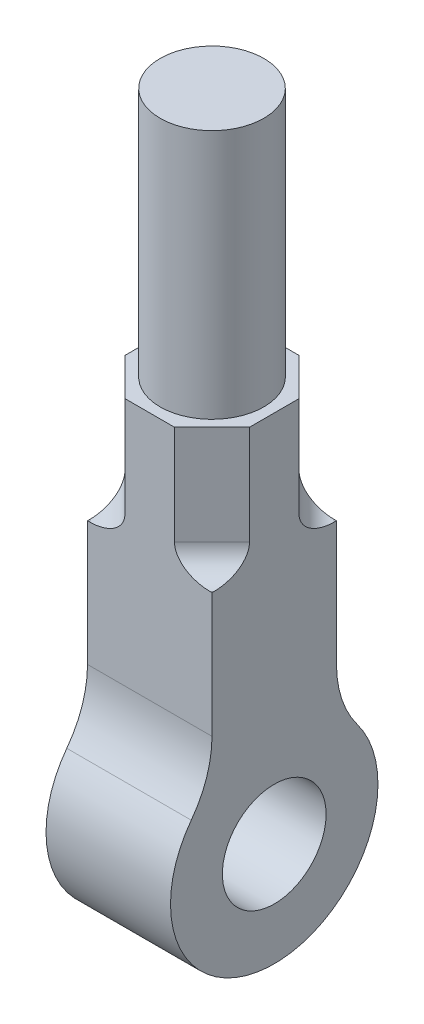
ISO-10303-21;
HEADER;
FILE_DESCRIPTION(('STEP AP214'),'2;1');
FILE_NAME('part.step','',(''),(''),'','','');
FILE_SCHEMA(('AUTOMOTIVE_DESIGN { 1 0 10303 214 1 1 1 1 }'));
ENDSEC;
DATA;
#1=APPLICATION_CONTEXT('core data for automotive mechanical design processes');
#2=APPLICATION_PROTOCOL_DEFINITION('international standard','automotive_design',2000,#1);
#3=PRODUCT_CONTEXT('',#1,'mechanical');
#4=PRODUCT('Part','Part','',(#3));
#5=PRODUCT_RELATED_PRODUCT_CATEGORY('part','',(#4));
#6=PRODUCT_DEFINITION_FORMATION('','',#4);
#7=PRODUCT_DEFINITION_CONTEXT('part definition',#1,'design');
#8=PRODUCT_DEFINITION('design','',#6,#7);
#9=PRODUCT_DEFINITION_SHAPE('','',#8);
#10=(LENGTH_UNIT() NAMED_UNIT(*) SI_UNIT(.MILLI.,.METRE.));
#11=(NAMED_UNIT(*) PLANE_ANGLE_UNIT() SI_UNIT($,.RADIAN.));
#12=(NAMED_UNIT(*) SI_UNIT($,.STERADIAN.) SOLID_ANGLE_UNIT());
#13=UNCERTAINTY_MEASURE_WITH_UNIT(LENGTH_MEASURE(1.E-05),#10,'distance_accuracy_value','');
#14=(GEOMETRIC_REPRESENTATION_CONTEXT(3) GLOBAL_UNCERTAINTY_ASSIGNED_CONTEXT((#13)) GLOBAL_UNIT_ASSIGNED_CONTEXT((#10,
#11,#12)) REPRESENTATION_CONTEXT('',''));
#15=CARTESIAN_POINT('',(0.,0.,0.));
#16=DIRECTION('',(0.,0.,1.));
#17=DIRECTION('',(1.,0.,0.));
#18=AXIS2_PLACEMENT_3D('',#15,#16,#17);
#19=CARTESIAN_POINT('',(60.,60.,-80.));
#20=DIRECTION('',(-1.,0.,0.));
#21=DIRECTION('',(0.,0.,1.));
#22=AXIS2_PLACEMENT_3D('',#19,#20,#21);
#23=PLANE('',#22);
#24=DIRECTION('',(0.,0.,-1.));
#25=VECTOR('',#24,1.);
#26=CARTESIAN_POINT('',(60.,120.,0.));
#27=LINE('',#26,#25);
#28=CARTESIAN_POINT('',(60.,120.,-28.9105627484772));
#29=VERTEX_POINT('',#28);
#30=CARTESIAN_POINT('',(60.,120.,-30.));
#31=VERTEX_POINT('',#30);
#32=EDGE_CURVE('E339',#29,#31,#27,.T.);
#33=ORIENTED_EDGE('',*,*,#32,.F.);
#34=CARTESIAN_POINT('',(60.,132.,-28.9105627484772));
#35=DIRECTION('',(-1.,0.,0.));
#36=DIRECTION('',(0.,0.,1.));
#37=AXIS2_PLACEMENT_3D('',#34,#35,#36);
#38=ELLIPSE('',#37,16.9705627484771,12.);
#39=CARTESIAN_POINT('',(60.,132.,-11.94));
#40=VERTEX_POINT('',#39);
#41=EDGE_CURVE('E224',#29,#40,#38,.T.);
#42=ORIENTED_EDGE('',*,*,#41,.T.);
#43=DIRECTION('',(0.,1.,0.));
#44=VECTOR('',#43,1.);
#45=CARTESIAN_POINT('',(60.,120.,-11.94));
#46=LINE('',#45,#44);
#47=CARTESIAN_POINT('',(60.,180.,-11.94));
#48=VERTEX_POINT('',#47);
#49=EDGE_CURVE('E333',#40,#48,#46,.T.);
#50=ORIENTED_EDGE('',*,*,#49,.T.);
#51=DIRECTION('',(0.,0.,1.));
#52=VECTOR('',#51,1.);
#53=CARTESIAN_POINT('',(60.,180.,30.));
#54=LINE('',#53,#52);
#55=CARTESIAN_POINT('',(60.,180.,11.9399999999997));
#56=VERTEX_POINT('',#55);
#57=EDGE_CURVE('E273',#48,#56,#54,.T.);
#58=ORIENTED_EDGE('',*,*,#57,.T.);
#59=DIRECTION('',(0.,1.,0.));
#60=VECTOR('',#59,1.);
#61=CARTESIAN_POINT('',(60.,120.,11.9399999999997));
#62=LINE('',#61,#60);
#63=CARTESIAN_POINT('',(60.,132.,11.9399999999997));
#64=VERTEX_POINT('',#63);
#65=EDGE_CURVE('E241',#64,#56,#62,.T.);
#66=ORIENTED_EDGE('',*,*,#65,.F.);
#67=CARTESIAN_POINT('',(60.,132.,28.9105627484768));
#68=DIRECTION('',(-1.,0.,0.));
#69=DIRECTION('',(0.,0.,1.));
#70=AXIS2_PLACEMENT_3D('',#67,#68,#69);
#71=ELLIPSE('',#70,16.9705627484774,12.);
#72=CARTESIAN_POINT('',(60.,120.,28.9105627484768));
#73=VERTEX_POINT('',#72);
#74=EDGE_CURVE('E230',#64,#73,#71,.T.);
#75=ORIENTED_EDGE('',*,*,#74,.T.);
#76=DIRECTION('',(0.,0.,-1.));
#77=VECTOR('',#76,1.);
#78=CARTESIAN_POINT('',(60.,120.,0.));
#79=LINE('',#78,#77);
#80=CARTESIAN_POINT('',(60.,120.,30.));
#81=VERTEX_POINT('',#80);
#82=EDGE_CURVE('E238',#81,#73,#79,.T.);
#83=ORIENTED_EDGE('',*,*,#82,.F.);
#84=DIRECTION('',(0.,-1.,0.));
#85=VECTOR('',#84,1.);
#86=CARTESIAN_POINT('',(60.,60.,30.));
#87=LINE('',#86,#85);
#88=CARTESIAN_POINT('',(60.,60.,30.));
#89=VERTEX_POINT('',#88);
#90=EDGE_CURVE('E275',#81,#89,#87,.T.);
#91=ORIENTED_EDGE('',*,*,#90,.T.);
#92=CARTESIAN_POINT('',(60.,60.,80.));
#93=DIRECTION('',(-1.,0.,0.));
#94=DIRECTION('',(0.,0.,1.));
#95=AXIS2_PLACEMENT_3D('',#92,#93,#94);
#96=CIRCLE('',#95,50.);
#97=CARTESIAN_POINT('',(60.,30.,40.));
#98=VERTEX_POINT('',#97);
#99=EDGE_CURVE('E277',#89,#98,#96,.T.);
#100=ORIENTED_EDGE('',*,*,#99,.T.);
#101=CARTESIAN_POINT('',(60.,0.,0.));
#102=DIRECTION('',(1.,0.,0.));
#103=DIRECTION('',(0.,0.,-1.));
#104=AXIS2_PLACEMENT_3D('',#101,#102,#103);
#105=CIRCLE('',#104,50.);
#106=CARTESIAN_POINT('',(60.,30.,-40.));
#107=VERTEX_POINT('',#106);
#108=EDGE_CURVE('E279',#98,#107,#105,.T.);
#109=ORIENTED_EDGE('',*,*,#108,.T.);
#110=CARTESIAN_POINT('',(60.,60.,-80.));
#111=DIRECTION('',(-1.,0.,0.));
#112=DIRECTION('',(0.,0.,1.));
#113=AXIS2_PLACEMENT_3D('',#110,#111,#112);
#114=CIRCLE('',#113,50.);
#115=CARTESIAN_POINT('',(60.,60.,-30.));
#116=VERTEX_POINT('',#115);
#117=EDGE_CURVE('E266',#107,#116,#114,.T.);
#118=ORIENTED_EDGE('',*,*,#117,.T.);
#119=DIRECTION('',(0.,1.,0.));
#120=VECTOR('',#119,1.);
#121=CARTESIAN_POINT('',(60.,60.,-30.));
#122=LINE('',#121,#120);
#123=EDGE_CURVE('E269',#116,#31,#122,.T.);
#124=ORIENTED_EDGE('',*,*,#123,.T.);
#125=EDGE_LOOP('',(#33,#42,#50,#58,#66,#75,#83,#91,#100,#109,#118,#124));
#126=FACE_BOUND('',#125,.T.);
#127=CARTESIAN_POINT('',(60.,0.,0.));
#128=DIRECTION('',(1.,0.,0.));
#129=DIRECTION('',(0.,0.,-1.));
#130=AXIS2_PLACEMENT_3D('',#127,#128,#129);
#131=CIRCLE('',#130,25.);
#132=CARTESIAN_POINT('',(60.,0.,-25.));
#133=VERTEX_POINT('',#132);
#134=EDGE_CURVE('E257',#133,#133,#131,.T.);
#135=ORIENTED_EDGE('',*,*,#134,.F.);
#136=EDGE_LOOP('',(#135));
#137=FACE_BOUND('',#136,.T.);
#138=ADVANCED_FACE('F39',(#126,#137),#23,.F.);
#139=CARTESIAN_POINT('',(0.,60.,-80.));
#140=DIRECTION('',(-1.,0.,0.));
#141=DIRECTION('',(0.,0.,1.));
#142=AXIS2_PLACEMENT_3D('',#139,#140,#141);
#143=PLANE('',#142);
#144=DIRECTION('',(0.,1.,0.));
#145=VECTOR('',#144,1.);
#146=CARTESIAN_POINT('',(0.,120.,-11.9399999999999));
#147=LINE('',#146,#145);
#148=CARTESIAN_POINT('',(0.,132.,-11.9399999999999));
#149=VERTEX_POINT('',#148);
#150=CARTESIAN_POINT('',(0.,180.,-11.9400000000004));
#151=VERTEX_POINT('',#150);
#152=EDGE_CURVE('E330',#149,#151,#147,.T.);
#153=ORIENTED_EDGE('',*,*,#152,.F.);
#154=CARTESIAN_POINT('',(0.,132.,-28.9105627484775));
#155=DIRECTION('',(-1.,0.,0.));
#156=DIRECTION('',(0.,0.,-1.));
#157=AXIS2_PLACEMENT_3D('',#154,#155,#156);
#158=ELLIPSE('',#157,16.9705627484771,12.);
#159=CARTESIAN_POINT('',(0.,120.,-28.9105627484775));
#160=VERTEX_POINT('',#159);
#161=EDGE_CURVE('E222',#149,#160,#158,.F.);
#162=ORIENTED_EDGE('',*,*,#161,.T.);
#163=DIRECTION('',(0.,0.,1.));
#164=VECTOR('',#163,1.);
#165=CARTESIAN_POINT('',(0.,120.,0.));
#166=LINE('',#165,#164);
#167=CARTESIAN_POINT('',(0.,120.,-30.));
#168=VERTEX_POINT('',#167);
#169=EDGE_CURVE('E324',#168,#160,#166,.T.);
#170=ORIENTED_EDGE('',*,*,#169,.F.);
#171=DIRECTION('',(0.,1.,0.));
#172=VECTOR('',#171,1.);
#173=CARTESIAN_POINT('',(0.,60.,-30.));
#174=LINE('',#173,#172);
#175=CARTESIAN_POINT('',(0.,60.,-30.));
#176=VERTEX_POINT('',#175);
#177=EDGE_CURVE('E284',#176,#168,#174,.T.);
#178=ORIENTED_EDGE('',*,*,#177,.F.);
#179=CARTESIAN_POINT('',(0.,60.,-80.));
#180=DIRECTION('',(-1.,0.,0.));
#181=DIRECTION('',(0.,0.,1.));
#182=AXIS2_PLACEMENT_3D('',#179,#180,#181);
#183=CIRCLE('',#182,50.);
#184=CARTESIAN_POINT('',(0.,30.,-40.));
#185=VERTEX_POINT('',#184);
#186=EDGE_CURVE('E264',#185,#176,#183,.T.);
#187=ORIENTED_EDGE('',*,*,#186,.F.);
#188=CARTESIAN_POINT('',(0.,0.,0.));
#189=DIRECTION('',(1.,0.,0.));
#190=DIRECTION('',(0.,0.,-1.));
#191=AXIS2_PLACEMENT_3D('',#188,#189,#190);
#192=CIRCLE('',#191,50.);
#193=CARTESIAN_POINT('',(0.,30.,40.));
#194=VERTEX_POINT('',#193);
#195=EDGE_CURVE('E270',#194,#185,#192,.T.);
#196=ORIENTED_EDGE('',*,*,#195,.F.);
#197=CARTESIAN_POINT('',(0.,60.,80.));
#198=DIRECTION('',(-1.,0.,0.));
#199=DIRECTION('',(0.,0.,1.));
#200=AXIS2_PLACEMENT_3D('',#197,#198,#199);
#201=CIRCLE('',#200,50.);
#202=CARTESIAN_POINT('',(0.,60.,30.));
#203=VERTEX_POINT('',#202);
#204=EDGE_CURVE('E290',#203,#194,#201,.T.);
#205=ORIENTED_EDGE('',*,*,#204,.F.);
#206=DIRECTION('',(0.,-1.,0.));
#207=VECTOR('',#206,1.);
#208=CARTESIAN_POINT('',(0.,60.,30.));
#209=LINE('',#208,#207);
#210=CARTESIAN_POINT('',(0.,120.,30.));
#211=VERTEX_POINT('',#210);
#212=EDGE_CURVE('E288',#211,#203,#209,.T.);
#213=ORIENTED_EDGE('',*,*,#212,.F.);
#214=DIRECTION('',(0.,0.,1.));
#215=VECTOR('',#214,1.);
#216=CARTESIAN_POINT('',(0.,120.,0.));
#217=LINE('',#216,#215);
#218=CARTESIAN_POINT('',(0.,120.,28.9105627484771));
#219=VERTEX_POINT('',#218);
#220=EDGE_CURVE('E169',#219,#211,#217,.T.);
#221=ORIENTED_EDGE('',*,*,#220,.F.);
#222=CARTESIAN_POINT('',(0.,132.,28.9105627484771));
#223=DIRECTION('',(-1.,0.,0.));
#224=DIRECTION('',(0.,0.,-1.));
#225=AXIS2_PLACEMENT_3D('',#222,#223,#224);
#226=ELLIPSE('',#225,16.9705627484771,12.);
#227=CARTESIAN_POINT('',(0.,132.,11.94));
#228=VERTEX_POINT('',#227);
#229=EDGE_CURVE('E47',#219,#228,#226,.F.);
#230=ORIENTED_EDGE('',*,*,#229,.T.);
#231=DIRECTION('',(0.,1.,0.));
#232=VECTOR('',#231,1.);
#233=CARTESIAN_POINT('',(0.,120.,11.94));
#234=LINE('',#233,#232);
#235=CARTESIAN_POINT('',(0.,180.,11.94));
#236=VERTEX_POINT('',#235);
#237=EDGE_CURVE('E168',#228,#236,#234,.T.);
#238=ORIENTED_EDGE('',*,*,#237,.T.);
#239=DIRECTION('',(0.,0.,1.));
#240=VECTOR('',#239,1.);
#241=CARTESIAN_POINT('',(0.,180.,30.));
#242=LINE('',#241,#240);
#243=EDGE_CURVE('E179',#151,#236,#242,.T.);
#244=ORIENTED_EDGE('',*,*,#243,.F.);
#245=EDGE_LOOP('',(#153,#162,#170,#178,#187,#196,#205,#213,#221,#230,#238,#244));
#246=FACE_BOUND('',#245,.T.);
#247=CARTESIAN_POINT('',(0.,0.,0.));
#248=DIRECTION('',(1.,0.,0.));
#249=DIRECTION('',(0.,0.,-1.));
#250=AXIS2_PLACEMENT_3D('',#247,#248,#249);
#251=CIRCLE('',#250,25.);
#252=CARTESIAN_POINT('',(0.,0.,-25.));
#253=VERTEX_POINT('',#252);
#254=EDGE_CURVE('E254',#253,#253,#251,.T.);
#255=ORIENTED_EDGE('',*,*,#254,.T.);
#256=EDGE_LOOP('',(#255));
#257=FACE_BOUND('',#256,.T.);
#258=ADVANCED_FACE('F306',(#246,#257),#143,.T.);
#259=CARTESIAN_POINT('',(60.,60.,-80.));
#260=DIRECTION('',(-1.,0.,0.));
#261=DIRECTION('',(0.,0.,1.));
#262=AXIS2_PLACEMENT_3D('',#259,#260,#261);
#263=CYLINDRICAL_SURFACE('',#262,50.);
#264=ORIENTED_EDGE('',*,*,#186,.T.);
#265=DIRECTION('',(-1.,0.,0.));
#266=VECTOR('',#265,1.);
#267=CARTESIAN_POINT('',(60.,60.,-30.));
#268=LINE('',#267,#266);
#269=EDGE_CURVE('E191',#116,#176,#268,.T.);
#270=ORIENTED_EDGE('',*,*,#269,.F.);
#271=ORIENTED_EDGE('',*,*,#117,.F.);
#272=DIRECTION('',(-1.,0.,0.));
#273=VECTOR('',#272,1.);
#274=CARTESIAN_POINT('',(60.,30.,-40.));
#275=LINE('',#274,#273);
#276=EDGE_CURVE('E281',#107,#185,#275,.T.);
#277=ORIENTED_EDGE('',*,*,#276,.T.);
#278=EDGE_LOOP('',(#264,#270,#271,#277));
#279=FACE_BOUND('',#278,.T.);
#280=ADVANCED_FACE('F312',(#279),#263,.F.);
#281=CARTESIAN_POINT('',(60.,60.,-30.));
#282=DIRECTION('',(0.,0.,1.));
#283=DIRECTION('',(1.,0.,0.));
#284=AXIS2_PLACEMENT_3D('',#281,#282,#283);
#285=PLANE('',#284);
#286=DIRECTION('',(-1.,0.,0.));
#287=VECTOR('',#286,1.);
#288=CARTESIAN_POINT('',(60.,180.,-30.));
#289=LINE('',#288,#287);
#290=CARTESIAN_POINT('',(41.94,180.,-30.));
#291=VERTEX_POINT('',#290);
#292=CARTESIAN_POINT('',(18.0599999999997,180.,-30.));
#293=VERTEX_POINT('',#292);
#294=EDGE_CURVE('E187',#291,#293,#289,.T.);
#295=ORIENTED_EDGE('',*,*,#294,.F.);
#296=DIRECTION('',(0.,1.,0.));
#297=VECTOR('',#296,1.);
#298=CARTESIAN_POINT('',(41.94,120.,-30.));
#299=LINE('',#298,#297);
#300=CARTESIAN_POINT('',(41.94,132.,-30.));
#301=VERTEX_POINT('',#300);
#302=EDGE_CURVE('E342',#301,#291,#299,.T.);
#303=ORIENTED_EDGE('',*,*,#302,.F.);
#304=CARTESIAN_POINT('',(58.9105627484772,132.,-30.));
#305=DIRECTION('',(0.,0.,1.));
#306=DIRECTION('',(1.,0.,0.));
#307=AXIS2_PLACEMENT_3D('',#304,#305,#306);
#308=ELLIPSE('',#307,16.9705627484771,12.);
#309=CARTESIAN_POINT('',(58.9105627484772,120.,-30.));
#310=VERTEX_POINT('',#309);
#311=EDGE_CURVE('E226',#301,#310,#308,.T.);
#312=ORIENTED_EDGE('',*,*,#311,.T.);
#313=DIRECTION('',(-1.,0.,0.));
#314=VECTOR('',#313,1.);
#315=CARTESIAN_POINT('',(0.,120.,-30.));
#316=LINE('',#315,#314);
#317=EDGE_CURVE('E336',#31,#310,#316,.T.);
#318=ORIENTED_EDGE('',*,*,#317,.F.);
#319=ORIENTED_EDGE('',*,*,#123,.F.);
#320=ORIENTED_EDGE('',*,*,#269,.T.);
#321=ORIENTED_EDGE('',*,*,#177,.T.);
#322=DIRECTION('',(-1.,0.,0.));
#323=VECTOR('',#322,1.);
#324=CARTESIAN_POINT('',(0.,120.,-30.));
#325=LINE('',#324,#323);
#326=CARTESIAN_POINT('',(1.0894372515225,120.,-30.));
#327=VERTEX_POINT('',#326);
#328=EDGE_CURVE('E327',#327,#168,#325,.T.);
#329=ORIENTED_EDGE('',*,*,#328,.F.);
#330=CARTESIAN_POINT('',(1.0894372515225,132.,-30.));
#331=DIRECTION('',(0.,0.,1.));
#332=DIRECTION('',(1.,0.,0.));
#333=AXIS2_PLACEMENT_3D('',#330,#331,#332);
#334=ELLIPSE('',#333,16.9705627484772,12.);
#335=CARTESIAN_POINT('',(18.0599999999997,132.,-30.));
#336=VERTEX_POINT('',#335);
#337=EDGE_CURVE('E220',#327,#336,#334,.T.);
#338=ORIENTED_EDGE('',*,*,#337,.T.);
#339=DIRECTION('',(0.,1.,0.));
#340=VECTOR('',#339,1.);
#341=CARTESIAN_POINT('',(18.0599999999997,120.,-30.));
#342=LINE('',#341,#340);
#343=EDGE_CURVE('E181',#336,#293,#342,.T.);
#344=ORIENTED_EDGE('',*,*,#343,.T.);
#345=EDGE_LOOP('',(#295,#303,#312,#318,#319,#320,#321,#329,#338,#344));
#346=FACE_BOUND('',#345,.T.);
#347=ADVANCED_FACE('F356',(#346),#285,.F.);
#348=CARTESIAN_POINT('',(60.,180.,30.));
#349=DIRECTION('',(0.,-1.,0.));
#350=DIRECTION('',(0.,0.,-1.));
#351=AXIS2_PLACEMENT_3D('',#348,#349,#350);
#352=PLANE('',#351);
#353=CARTESIAN_POINT('',(30.,180.,0.));
#354=DIRECTION('',(0.,1.,0.));
#355=DIRECTION('',(0.,0.,1.));
#356=AXIS2_PLACEMENT_3D('',#353,#354,#355);
#357=CIRCLE('',#356,25.);
#358=CARTESIAN_POINT('',(30.,180.,25.));
#359=VERTEX_POINT('',#358);
#360=EDGE_CURVE('E200',#359,#359,#357,.T.);
#361=ORIENTED_EDGE('',*,*,#360,.F.);
#362=EDGE_LOOP('',(#361));
#363=FACE_BOUND('',#362,.T.);
#364=ORIENTED_EDGE('',*,*,#57,.F.);
#365=DIRECTION('',(0.707106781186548,0.,0.707106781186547));
#366=VECTOR('',#365,1.);
#367=CARTESIAN_POINT('',(35.97,180.,-35.97));
#368=LINE('',#367,#366);
#369=EDGE_CURVE('E340',#291,#48,#368,.T.);
#370=ORIENTED_EDGE('',*,*,#369,.F.);
#371=ORIENTED_EDGE('',*,*,#294,.T.);
#372=DIRECTION('',(0.70710678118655,0.,-0.707106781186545));
#373=VECTOR('',#372,1.);
#374=CARTESIAN_POINT('',(-5.97000000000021,180.,-5.97000000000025));
#375=LINE('',#374,#373);
#376=EDGE_CURVE('E328',#151,#293,#375,.T.);
#377=ORIENTED_EDGE('',*,*,#376,.F.);
#378=ORIENTED_EDGE('',*,*,#243,.T.);
#379=DIRECTION('',(-0.707106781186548,0.,-0.707106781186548));
#380=VECTOR('',#379,1.);
#381=CARTESIAN_POINT('',(-5.97,180.,5.97));
#382=LINE('',#381,#380);
#383=CARTESIAN_POINT('',(18.06,180.,30.));
#384=VERTEX_POINT('',#383);
#385=EDGE_CURVE('E163',#384,#236,#382,.T.);
#386=ORIENTED_EDGE('',*,*,#385,.F.);
#387=DIRECTION('',(-1.,0.,0.));
#388=VECTOR('',#387,1.);
#389=CARTESIAN_POINT('',(60.,180.,30.));
#390=LINE('',#389,#388);
#391=CARTESIAN_POINT('',(41.94,180.,30.));
#392=VERTEX_POINT('',#391);
#393=EDGE_CURVE('E176',#392,#384,#390,.T.);
#394=ORIENTED_EDGE('',*,*,#393,.F.);
#395=DIRECTION('',(-0.707106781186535,0.,0.70710678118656));
#396=VECTOR('',#395,1.);
#397=CARTESIAN_POINT('',(35.9700000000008,180.,35.9699999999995));
#398=LINE('',#397,#396);
#399=EDGE_CURVE('E249',#56,#392,#398,.T.);
#400=ORIENTED_EDGE('',*,*,#399,.F.);
#401=EDGE_LOOP('',(#364,#370,#371,#377,#378,#386,#394,#400));
#402=FACE_BOUND('',#401,.T.);
#403=ADVANCED_FACE('F174',(#363,#402),#352,.F.);
#404=CARTESIAN_POINT('',(60.,60.,30.));
#405=DIRECTION('',(0.,0.,-1.));
#406=DIRECTION('',(-1.,0.,0.));
#407=AXIS2_PLACEMENT_3D('',#404,#405,#406);
#408=PLANE('',#407);
#409=ORIENTED_EDGE('',*,*,#393,.T.);
#410=DIRECTION('',(0.,1.,0.));
#411=VECTOR('',#410,1.);
#412=CARTESIAN_POINT('',(18.06,120.,30.));
#413=LINE('',#412,#411);
#414=CARTESIAN_POINT('',(18.06,132.,30.));
#415=VERTEX_POINT('',#414);
#416=EDGE_CURVE('E160',#415,#384,#413,.T.);
#417=ORIENTED_EDGE('',*,*,#416,.F.);
#418=CARTESIAN_POINT('',(1.08943725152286,132.,30.));
#419=DIRECTION('',(0.,0.,-1.));
#420=DIRECTION('',(-1.,0.,0.));
#421=AXIS2_PLACEMENT_3D('',#418,#419,#420);
#422=ELLIPSE('',#421,16.9705627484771,12.);
#423=CARTESIAN_POINT('',(1.08943725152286,120.,30.));
#424=VERTEX_POINT('',#423);
#425=EDGE_CURVE('E11',#415,#424,#422,.T.);
#426=ORIENTED_EDGE('',*,*,#425,.T.);
#427=DIRECTION('',(1.,0.,0.));
#428=VECTOR('',#427,1.);
#429=CARTESIAN_POINT('',(0.,120.,30.));
#430=LINE('',#429,#428);
#431=EDGE_CURVE('E180',#211,#424,#430,.T.);
#432=ORIENTED_EDGE('',*,*,#431,.F.);
#433=ORIENTED_EDGE('',*,*,#212,.T.);
#434=DIRECTION('',(-1.,0.,0.));
#435=VECTOR('',#434,1.);
#436=CARTESIAN_POINT('',(60.,60.,30.));
#437=LINE('',#436,#435);
#438=EDGE_CURVE('E188',#89,#203,#437,.T.);
#439=ORIENTED_EDGE('',*,*,#438,.F.);
#440=ORIENTED_EDGE('',*,*,#90,.F.);
#441=DIRECTION('',(1.,0.,0.));
#442=VECTOR('',#441,1.);
#443=CARTESIAN_POINT('',(0.,120.,30.));
#444=LINE('',#443,#442);
#445=CARTESIAN_POINT('',(58.9105627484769,120.,30.));
#446=VERTEX_POINT('',#445);
#447=EDGE_CURVE('E248',#446,#81,#444,.T.);
#448=ORIENTED_EDGE('',*,*,#447,.F.);
#449=CARTESIAN_POINT('',(58.9105627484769,132.,30.));
#450=DIRECTION('',(0.,0.,-1.));
#451=DIRECTION('',(-1.,0.,0.));
#452=AXIS2_PLACEMENT_3D('',#449,#450,#451);
#453=ELLIPSE('',#452,16.9705627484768,12.);
#454=CARTESIAN_POINT('',(41.94,132.,30.));
#455=VERTEX_POINT('',#454);
#456=EDGE_CURVE('E228',#446,#455,#453,.T.);
#457=ORIENTED_EDGE('',*,*,#456,.T.);
#458=DIRECTION('',(0.,1.,0.));
#459=VECTOR('',#458,1.);
#460=CARTESIAN_POINT('',(41.94,120.,30.));
#461=LINE('',#460,#459);
#462=EDGE_CURVE('E185',#455,#392,#461,.T.);
#463=ORIENTED_EDGE('',*,*,#462,.T.);
#464=EDGE_LOOP('',(#409,#417,#426,#432,#433,#439,#440,#448,#457,#463));
#465=FACE_BOUND('',#464,.T.);
#466=ADVANCED_FACE('F183',(#465),#408,.F.);
#467=CARTESIAN_POINT('',(60.,60.,80.));
#468=DIRECTION('',(-1.,0.,0.));
#469=DIRECTION('',(0.,0.,1.));
#470=AXIS2_PLACEMENT_3D('',#467,#468,#469);
#471=CYLINDRICAL_SURFACE('',#470,50.);
#472=ORIENTED_EDGE('',*,*,#204,.T.);
#473=DIRECTION('',(-1.,0.,0.));
#474=VECTOR('',#473,1.);
#475=CARTESIAN_POINT('',(60.,30.,40.));
#476=LINE('',#475,#474);
#477=EDGE_CURVE('E194',#98,#194,#476,.T.);
#478=ORIENTED_EDGE('',*,*,#477,.F.);
#479=ORIENTED_EDGE('',*,*,#99,.F.);
#480=ORIENTED_EDGE('',*,*,#438,.T.);
#481=EDGE_LOOP('',(#472,#478,#479,#480));
#482=FACE_BOUND('',#481,.T.);
#483=ADVANCED_FACE('F315',(#482),#471,.F.);
#484=CARTESIAN_POINT('',(60.,0.,0.));
#485=DIRECTION('',(-1.,0.,0.));
#486=DIRECTION('',(0.,0.,1.));
#487=AXIS2_PLACEMENT_3D('',#484,#485,#486);
#488=CYLINDRICAL_SURFACE('',#487,50.);
#489=ORIENTED_EDGE('',*,*,#195,.T.);
#490=ORIENTED_EDGE('',*,*,#276,.F.);
#491=ORIENTED_EDGE('',*,*,#108,.F.);
#492=ORIENTED_EDGE('',*,*,#477,.T.);
#493=EDGE_LOOP('',(#489,#490,#491,#492));
#494=FACE_BOUND('',#493,.T.);
#495=ADVANCED_FACE('F299',(#494),#488,.T.);
#496=CARTESIAN_POINT('',(60.,0.,0.));
#497=DIRECTION('',(-1.,0.,0.));
#498=DIRECTION('',(0.,0.,1.));
#499=AXIS2_PLACEMENT_3D('',#496,#497,#498);
#500=CYLINDRICAL_SURFACE('',#499,25.);
#501=ORIENTED_EDGE('',*,*,#134,.T.);
#502=EDGE_LOOP('',(#501));
#503=FACE_BOUND('',#502,.T.);
#504=ORIENTED_EDGE('',*,*,#254,.F.);
#505=EDGE_LOOP('',(#504));
#506=FACE_BOUND('',#505,.T.);
#507=ADVANCED_FACE('F384',(#503,#506),#500,.F.);
#508=CARTESIAN_POINT('',(35.9700000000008,120.,35.9699999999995));
#509=DIRECTION('',(-0.70710678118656,0.,-0.707106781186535));
#510=DIRECTION('',(-0.707106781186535,0.,0.70710678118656));
#511=AXIS2_PLACEMENT_3D('',#508,#509,#510);
#512=PLANE('',#511);
#513=ORIENTED_EDGE('',*,*,#462,.F.);
#514=DIRECTION('',(-0.707106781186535,0.,0.70710678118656));
#515=VECTOR('',#514,1.);
#516=CARTESIAN_POINT('',(35.9700000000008,132.,35.9699999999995));
#517=LINE('',#516,#515);
#518=EDGE_CURVE('E214',#455,#64,#517,.F.);
#519=ORIENTED_EDGE('',*,*,#518,.T.);
#520=ORIENTED_EDGE('',*,*,#65,.T.);
#521=ORIENTED_EDGE('',*,*,#399,.T.);
#522=EDGE_LOOP('',(#513,#519,#520,#521));
#523=FACE_BOUND('',#522,.T.);
#524=ADVANCED_FACE('F253',(#523),#512,.F.);
#525=CARTESIAN_POINT('',(0.,120.,0.));
#526=DIRECTION('',(0.,1.,0.));
#527=DIRECTION('',(0.,0.,1.));
#528=AXIS2_PLACEMENT_3D('',#525,#526,#527);
#529=PLANE('',#528);
#530=ORIENTED_EDGE('',*,*,#82,.T.);
#531=DIRECTION('',(-0.707106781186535,0.,0.70710678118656));
#532=VECTOR('',#531,1.);
#533=CARTESIAN_POINT('',(44.4552813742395,120.,44.4552813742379));
#534=LINE('',#533,#532);
#535=EDGE_CURVE('E211',#73,#446,#534,.T.);
#536=ORIENTED_EDGE('',*,*,#535,.T.);
#537=ORIENTED_EDGE('',*,*,#447,.T.);
#538=EDGE_LOOP('',(#530,#536,#537));
#539=FACE_BOUND('',#538,.T.);
#540=ADVANCED_FACE('F246',(#539),#529,.T.);
#541=CARTESIAN_POINT('',(-5.97,120.,5.97));
#542=DIRECTION('',(0.707106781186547,0.,-0.707106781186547));
#543=DIRECTION('',(-0.707106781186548,0.,-0.707106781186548));
#544=AXIS2_PLACEMENT_3D('',#541,#542,#543);
#545=PLANE('',#544);
#546=ORIENTED_EDGE('',*,*,#237,.F.);
#547=DIRECTION('',(-0.707106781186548,0.,-0.707106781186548));
#548=VECTOR('',#547,1.);
#549=CARTESIAN_POINT('',(-5.97,132.,5.97));
#550=LINE('',#549,#548);
#551=EDGE_CURVE('E54',#228,#415,#550,.F.);
#552=ORIENTED_EDGE('',*,*,#551,.T.);
#553=ORIENTED_EDGE('',*,*,#416,.T.);
#554=ORIENTED_EDGE('',*,*,#385,.T.);
#555=EDGE_LOOP('',(#546,#552,#553,#554));
#556=FACE_BOUND('',#555,.T.);
#557=ADVANCED_FACE('F162',(#556),#545,.F.);
#558=CARTESIAN_POINT('',(0.,120.,0.));
#559=DIRECTION('',(0.,1.,0.));
#560=DIRECTION('',(0.,0.,1.));
#561=AXIS2_PLACEMENT_3D('',#558,#559,#560);
#562=PLANE('',#561);
#563=ORIENTED_EDGE('',*,*,#431,.T.);
#564=DIRECTION('',(-0.707106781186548,0.,-0.707106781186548));
#565=VECTOR('',#564,1.);
#566=CARTESIAN_POINT('',(-14.4552813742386,120.,14.4552813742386));
#567=LINE('',#566,#565);
#568=EDGE_CURVE('E216',#424,#219,#567,.T.);
#569=ORIENTED_EDGE('',*,*,#568,.T.);
#570=ORIENTED_EDGE('',*,*,#220,.T.);
#571=EDGE_LOOP('',(#563,#569,#570));
#572=FACE_BOUND('',#571,.T.);
#573=ADVANCED_FACE('F365',(#572),#562,.T.);
#574=CARTESIAN_POINT('',(-5.97000000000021,120.,-5.97000000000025));
#575=DIRECTION('',(0.707106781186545,0.,0.70710678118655));
#576=DIRECTION('',(0.70710678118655,0.,-0.707106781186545));
#577=AXIS2_PLACEMENT_3D('',#574,#575,#576);
#578=PLANE('',#577);
#579=ORIENTED_EDGE('',*,*,#343,.F.);
#580=DIRECTION('',(0.70710678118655,0.,-0.707106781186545));
#581=VECTOR('',#580,1.);
#582=CARTESIAN_POINT('',(-5.97000000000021,132.,-5.97000000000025));
#583=LINE('',#582,#581);
#584=EDGE_CURVE('E204',#336,#149,#583,.F.);
#585=ORIENTED_EDGE('',*,*,#584,.T.);
#586=ORIENTED_EDGE('',*,*,#152,.T.);
#587=ORIENTED_EDGE('',*,*,#376,.T.);
#588=EDGE_LOOP('',(#579,#585,#586,#587));
#589=FACE_BOUND('',#588,.T.);
#590=ADVANCED_FACE('F361',(#589),#578,.F.);
#591=CARTESIAN_POINT('',(0.,120.,0.));
#592=DIRECTION('',(0.,1.,0.));
#593=DIRECTION('',(0.,0.,1.));
#594=AXIS2_PLACEMENT_3D('',#591,#592,#593);
#595=PLANE('',#594);
#596=ORIENTED_EDGE('',*,*,#169,.T.);
#597=DIRECTION('',(0.70710678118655,0.,-0.707106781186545));
#598=VECTOR('',#597,1.);
#599=CARTESIAN_POINT('',(-14.4552813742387,120.,-14.4552813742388));
#600=LINE('',#599,#598);
#601=EDGE_CURVE('E201',#160,#327,#600,.T.);
#602=ORIENTED_EDGE('',*,*,#601,.T.);
#603=ORIENTED_EDGE('',*,*,#328,.T.);
#604=EDGE_LOOP('',(#596,#602,#603));
#605=FACE_BOUND('',#604,.T.);
#606=ADVANCED_FACE('F372',(#605),#595,.T.);
#607=CARTESIAN_POINT('',(35.97,120.,-35.97));
#608=DIRECTION('',(-0.707106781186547,0.,0.707106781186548));
#609=DIRECTION('',(0.707106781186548,0.,0.707106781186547));
#610=AXIS2_PLACEMENT_3D('',#607,#608,#609);
#611=PLANE('',#610);
#612=ORIENTED_EDGE('',*,*,#49,.F.);
#613=DIRECTION('',(0.707106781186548,0.,0.707106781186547));
#614=VECTOR('',#613,1.);
#615=CARTESIAN_POINT('',(35.97,132.,-35.97));
#616=LINE('',#615,#614);
#617=EDGE_CURVE('E209',#40,#301,#616,.F.);
#618=ORIENTED_EDGE('',*,*,#617,.T.);
#619=ORIENTED_EDGE('',*,*,#302,.T.);
#620=ORIENTED_EDGE('',*,*,#369,.T.);
#621=EDGE_LOOP('',(#612,#618,#619,#620));
#622=FACE_BOUND('',#621,.T.);
#623=ADVANCED_FACE('F351',(#622),#611,.F.);
#624=CARTESIAN_POINT('',(0.,120.,0.));
#625=DIRECTION('',(0.,1.,0.));
#626=DIRECTION('',(0.,0.,1.));
#627=AXIS2_PLACEMENT_3D('',#624,#625,#626);
#628=PLANE('',#627);
#629=ORIENTED_EDGE('',*,*,#317,.T.);
#630=DIRECTION('',(0.707106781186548,0.,0.707106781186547));
#631=VECTOR('',#630,1.);
#632=CARTESIAN_POINT('',(44.4552813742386,120.,-44.4552813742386));
#633=LINE('',#632,#631);
#634=EDGE_CURVE('E206',#310,#29,#633,.T.);
#635=ORIENTED_EDGE('',*,*,#634,.T.);
#636=ORIENTED_EDGE('',*,*,#32,.T.);
#637=EDGE_LOOP('',(#629,#635,#636));
#638=FACE_BOUND('',#637,.T.);
#639=ADVANCED_FACE('F450',(#638),#628,.T.);
#640=CARTESIAN_POINT('',(30.,300.5,0.));
#641=DIRECTION('',(0.,-1.,0.));
#642=DIRECTION('',(0.,0.,-1.));
#643=AXIS2_PLACEMENT_3D('',#640,#641,#642);
#644=CYLINDRICAL_SURFACE('',#643,25.);
#645=CARTESIAN_POINT('',(30.,300.5,0.));
#646=DIRECTION('',(0.,1.,0.));
#647=DIRECTION('',(0.,0.,1.));
#648=AXIS2_PLACEMENT_3D('',#645,#646,#647);
#649=CIRCLE('',#648,25.);
#650=CARTESIAN_POINT('',(30.,300.5,25.));
#651=VERTEX_POINT('',#650);
#652=EDGE_CURVE('E345',#651,#651,#649,.T.);
#653=ORIENTED_EDGE('',*,*,#652,.F.);
#654=EDGE_LOOP('',(#653));
#655=FACE_BOUND('',#654,.T.);
#656=ORIENTED_EDGE('',*,*,#360,.T.);
#657=EDGE_LOOP('',(#656));
#658=FACE_BOUND('',#657,.T.);
#659=ADVANCED_FACE('F440',(#655,#658),#644,.T.);
#660=CARTESIAN_POINT('',(0.,300.5,0.));
#661=DIRECTION('',(0.,1.,0.));
#662=DIRECTION('',(0.,0.,1.));
#663=AXIS2_PLACEMENT_3D('',#660,#661,#662);
#664=PLANE('',#663);
#665=ORIENTED_EDGE('',*,*,#652,.T.);
#666=EDGE_LOOP('',(#665));
#667=FACE_BOUND('',#666,.T.);
#668=ADVANCED_FACE('F404',(#667),#664,.T.);
#669=CARTESIAN_POINT('',(-14.4552813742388,132.,-14.4552813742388));
#670=DIRECTION('',(0.70710678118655,0.,-0.707106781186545));
#671=DIRECTION('',(-0.707106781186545,0.,-0.70710678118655));
#672=AXIS2_PLACEMENT_3D('',#669,#670,#671);
#673=CYLINDRICAL_SURFACE('',#672,12.);
#674=ORIENTED_EDGE('',*,*,#161,.F.);
#675=ORIENTED_EDGE('',*,*,#584,.F.);
#676=ORIENTED_EDGE('',*,*,#337,.F.);
#677=ORIENTED_EDGE('',*,*,#601,.F.);
#678=EDGE_LOOP('',(#674,#675,#676,#677));
#679=FACE_BOUND('',#678,.T.);
#680=ADVANCED_FACE('F400',(#679),#673,.F.);
#681=CARTESIAN_POINT('',(44.4552813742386,132.,-44.4552813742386));
#682=DIRECTION('',(0.707106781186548,0.,0.707106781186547));
#683=DIRECTION('',(0.707106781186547,0.,-0.707106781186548));
#684=AXIS2_PLACEMENT_3D('',#681,#682,#683);
#685=CYLINDRICAL_SURFACE('',#684,12.);
#686=ORIENTED_EDGE('',*,*,#311,.F.);
#687=ORIENTED_EDGE('',*,*,#617,.F.);
#688=ORIENTED_EDGE('',*,*,#41,.F.);
#689=ORIENTED_EDGE('',*,*,#634,.F.);
#690=EDGE_LOOP('',(#686,#687,#688,#689));
#691=FACE_BOUND('',#690,.T.);
#692=ADVANCED_FACE('F403',(#691),#685,.F.);
#693=CARTESIAN_POINT('',(44.4552813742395,132.,44.4552813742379));
#694=DIRECTION('',(-0.707106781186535,0.,0.70710678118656));
#695=DIRECTION('',(0.70710678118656,0.,0.707106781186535));
#696=AXIS2_PLACEMENT_3D('',#693,#694,#695);
#697=CYLINDRICAL_SURFACE('',#696,12.);
#698=ORIENTED_EDGE('',*,*,#74,.F.);
#699=ORIENTED_EDGE('',*,*,#518,.F.);
#700=ORIENTED_EDGE('',*,*,#456,.F.);
#701=ORIENTED_EDGE('',*,*,#535,.F.);
#702=EDGE_LOOP('',(#698,#699,#700,#701));
#703=FACE_BOUND('',#702,.T.);
#704=ADVANCED_FACE('F251',(#703),#697,.F.);
#705=CARTESIAN_POINT('',(-14.4552813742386,132.,14.4552813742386));
#706=DIRECTION('',(-0.707106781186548,0.,-0.707106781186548));
#707=DIRECTION('',(-0.707106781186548,0.,0.707106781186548));
#708=AXIS2_PLACEMENT_3D('',#705,#706,#707);
#709=CYLINDRICAL_SURFACE('',#708,12.);
#710=ORIENTED_EDGE('',*,*,#425,.F.);
#711=ORIENTED_EDGE('',*,*,#551,.F.);
#712=ORIENTED_EDGE('',*,*,#229,.F.);
#713=ORIENTED_EDGE('',*,*,#568,.F.);
#714=EDGE_LOOP('',(#710,#711,#712,#713));
#715=FACE_BOUND('',#714,.T.);
#716=ADVANCED_FACE('F41',(#715),#709,.F.);
#717=CLOSED_SHELL('',(#138,#258,#280,#347,#403,#466,#483,#495,#507,#524,#540,#557,#573,#590,
#606,#623,#639,#659,#668,#680,#692,#704,#716));
#718=MANIFOLD_SOLID_BREP('B2',#717);
#719=ADVANCED_BREP_SHAPE_REPRESENTATION('',(#18,#718),#14);
#720=SHAPE_DEFINITION_REPRESENTATION(#9,#719);
ENDSEC;
END-ISO-10303-21;
